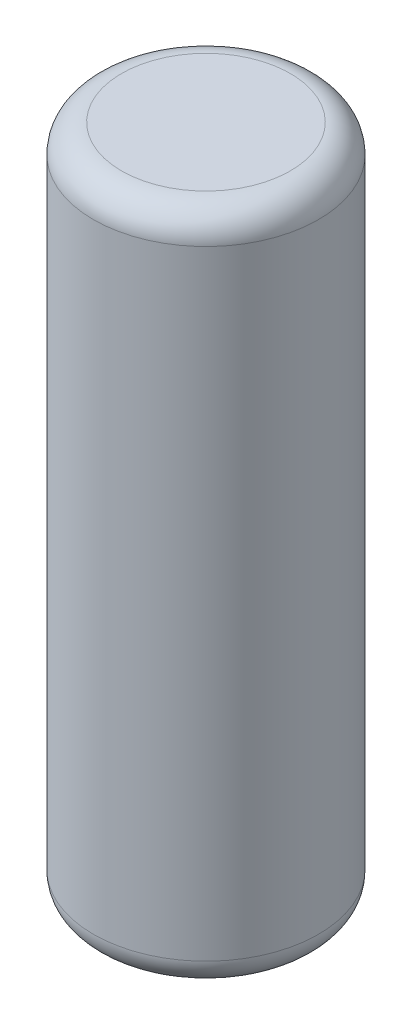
from build123d import *

# Parameters (mm, degrees)
SKETCH_1_R      = 2
EXTRUDE_1_DEPTH = 6
FILLET_1_R      = 0.5


with BuildPart() as part:
    # Sketch 1 → Extrude 1 (new, symmetric)
    with BuildSketch(Plane(origin=(0, 0, 0), x_dir=(1, 0, 0), z_dir=(0, 1, 0))):
        with Locations(Location((0, 0, 0), (0, 0, 270))):
            Circle(SKETCH_1_R)
    extrude(amount=EXTRUDE_1_DEPTH, both=True)

    # Fillet 1
    fillet_1_edges = [part.edges().sort_by_distance(p)[0] for p in [
        (0, -6, -2),
        (0, 6, -2),
    ]]
    fillet(fillet_1_edges, radius=FILLET_1_R)


solid = part.part
